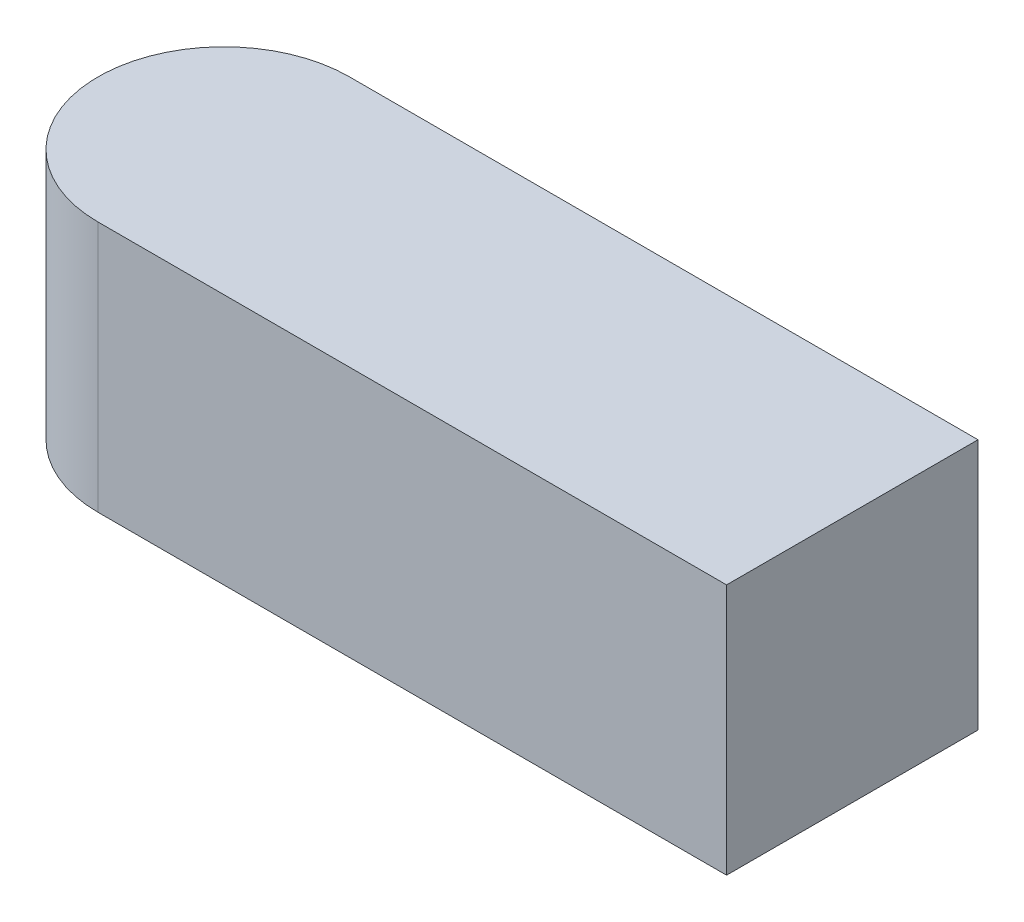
ISO-10303-21;
HEADER;
FILE_DESCRIPTION(('STEP AP214'),'2;1');
FILE_NAME('part.step','',(''),(''),'','','');
FILE_SCHEMA(('AUTOMOTIVE_DESIGN { 1 0 10303 214 1 1 1 1 }'));
ENDSEC;
DATA;
#1=APPLICATION_CONTEXT('core data for automotive mechanical design processes');
#2=APPLICATION_PROTOCOL_DEFINITION('international standard','automotive_design',2000,#1);
#3=PRODUCT_CONTEXT('',#1,'mechanical');
#4=PRODUCT('Part','Part','',(#3));
#5=PRODUCT_RELATED_PRODUCT_CATEGORY('part','',(#4));
#6=PRODUCT_DEFINITION_FORMATION('','',#4);
#7=PRODUCT_DEFINITION_CONTEXT('part definition',#1,'design');
#8=PRODUCT_DEFINITION('design','',#6,#7);
#9=PRODUCT_DEFINITION_SHAPE('','',#8);
#10=(LENGTH_UNIT() NAMED_UNIT(*) SI_UNIT(.MILLI.,.METRE.));
#11=(NAMED_UNIT(*) PLANE_ANGLE_UNIT() SI_UNIT($,.RADIAN.));
#12=(NAMED_UNIT(*) SI_UNIT($,.STERADIAN.) SOLID_ANGLE_UNIT());
#13=UNCERTAINTY_MEASURE_WITH_UNIT(LENGTH_MEASURE(1.E-05),#10,'distance_accuracy_value','');
#14=(GEOMETRIC_REPRESENTATION_CONTEXT(3) GLOBAL_UNCERTAINTY_ASSIGNED_CONTEXT((#13)) GLOBAL_UNIT_ASSIGNED_CONTEXT((#10,
#11,#12)) REPRESENTATION_CONTEXT('',''));
#15=CARTESIAN_POINT('',(0.,0.,0.));
#16=DIRECTION('',(0.,0.,1.));
#17=DIRECTION('',(1.,0.,0.));
#18=AXIS2_PLACEMENT_3D('',#15,#16,#17);
#19=CARTESIAN_POINT('',(15.,6.,-3.));
#20=DIRECTION('',(-1.,0.,0.));
#21=DIRECTION('',(0.,0.,1.));
#22=AXIS2_PLACEMENT_3D('',#19,#20,#21);
#23=PLANE('',#22);
#24=DIRECTION('',(0.,0.,-1.));
#25=VECTOR('',#24,1.);
#26=CARTESIAN_POINT('',(15.,0.,-3.));
#27=LINE('',#26,#25);
#28=CARTESIAN_POINT('',(15.,0.,3.));
#29=VERTEX_POINT('',#28);
#30=CARTESIAN_POINT('',(15.,0.,-3.));
#31=VERTEX_POINT('',#30);
#32=EDGE_CURVE('E76',#29,#31,#27,.T.);
#33=ORIENTED_EDGE('',*,*,#32,.T.);
#34=DIRECTION('',(0.,-1.,0.));
#35=VECTOR('',#34,1.);
#36=CARTESIAN_POINT('',(15.,6.,-3.));
#37=LINE('',#36,#35);
#38=CARTESIAN_POINT('',(15.,6.,-3.));
#39=VERTEX_POINT('',#38);
#40=EDGE_CURVE('E11',#39,#31,#37,.T.);
#41=ORIENTED_EDGE('',*,*,#40,.F.);
#42=DIRECTION('',(0.,0.,-1.));
#43=VECTOR('',#42,1.);
#44=CARTESIAN_POINT('',(15.,6.,-3.));
#45=LINE('',#44,#43);
#46=CARTESIAN_POINT('',(15.,6.,3.));
#47=VERTEX_POINT('',#46);
#48=EDGE_CURVE('E94',#47,#39,#45,.T.);
#49=ORIENTED_EDGE('',*,*,#48,.F.);
#50=DIRECTION('',(0.,-1.,0.));
#51=VECTOR('',#50,1.);
#52=CARTESIAN_POINT('',(15.,6.,3.));
#53=LINE('',#52,#51);
#54=EDGE_CURVE('E88',#47,#29,#53,.T.);
#55=ORIENTED_EDGE('',*,*,#54,.T.);
#56=EDGE_LOOP('',(#33,#41,#49,#55));
#57=FACE_BOUND('',#56,.T.);
#58=ADVANCED_FACE('F32',(#57),#23,.F.);
#59=CARTESIAN_POINT('',(0.,6.,-3.));
#60=DIRECTION('',(0.,0.,1.));
#61=DIRECTION('',(1.,0.,0.));
#62=AXIS2_PLACEMENT_3D('',#59,#60,#61);
#63=PLANE('',#62);
#64=DIRECTION('',(-1.,0.,0.));
#65=VECTOR('',#64,1.);
#66=CARTESIAN_POINT('',(0.,0.,-3.));
#67=LINE('',#66,#65);
#68=CARTESIAN_POINT('',(0.,0.,-3.));
#69=VERTEX_POINT('',#68);
#70=EDGE_CURVE('E72',#31,#69,#67,.T.);
#71=ORIENTED_EDGE('',*,*,#70,.T.);
#72=DIRECTION('',(0.,-1.,0.));
#73=VECTOR('',#72,1.);
#74=CARTESIAN_POINT('',(0.,6.,-3.));
#75=LINE('',#74,#73);
#76=CARTESIAN_POINT('',(0.,6.,-3.));
#77=VERTEX_POINT('',#76);
#78=EDGE_CURVE('E39',#77,#69,#75,.T.);
#79=ORIENTED_EDGE('',*,*,#78,.F.);
#80=DIRECTION('',(-1.,0.,0.));
#81=VECTOR('',#80,1.);
#82=CARTESIAN_POINT('',(0.,6.,-3.));
#83=LINE('',#82,#81);
#84=EDGE_CURVE('E84',#39,#77,#83,.T.);
#85=ORIENTED_EDGE('',*,*,#84,.F.);
#86=ORIENTED_EDGE('',*,*,#40,.T.);
#87=EDGE_LOOP('',(#71,#79,#85,#86));
#88=FACE_BOUND('',#87,.T.);
#89=ADVANCED_FACE('F83',(#88),#63,.F.);
#90=CARTESIAN_POINT('',(0.,6.,0.));
#91=DIRECTION('',(0.,-1.,0.));
#92=DIRECTION('',(0.,0.,-1.));
#93=AXIS2_PLACEMENT_3D('',#90,#91,#92);
#94=CYLINDRICAL_SURFACE('',#93,3.);
#95=CARTESIAN_POINT('',(0.,0.,0.));
#96=DIRECTION('',(0.,1.,0.));
#97=DIRECTION('',(0.,0.,1.));
#98=AXIS2_PLACEMENT_3D('',#95,#96,#97);
#99=CIRCLE('',#98,3.);
#100=CARTESIAN_POINT('',(0.,0.,3.));
#101=VERTEX_POINT('',#100);
#102=EDGE_CURVE('E77',#69,#101,#99,.T.);
#103=ORIENTED_EDGE('',*,*,#102,.T.);
#104=DIRECTION('',(0.,-1.,0.));
#105=VECTOR('',#104,1.);
#106=CARTESIAN_POINT('',(0.,6.,3.));
#107=LINE('',#106,#105);
#108=CARTESIAN_POINT('',(0.,6.,3.));
#109=VERTEX_POINT('',#108);
#110=EDGE_CURVE('E100',#109,#101,#107,.T.);
#111=ORIENTED_EDGE('',*,*,#110,.F.);
#112=CARTESIAN_POINT('',(0.,6.,0.));
#113=DIRECTION('',(0.,1.,0.));
#114=DIRECTION('',(0.,0.,1.));
#115=AXIS2_PLACEMENT_3D('',#112,#113,#114);
#116=CIRCLE('',#115,3.);
#117=EDGE_CURVE('E51',#77,#109,#116,.T.);
#118=ORIENTED_EDGE('',*,*,#117,.F.);
#119=ORIENTED_EDGE('',*,*,#78,.T.);
#120=EDGE_LOOP('',(#103,#111,#118,#119));
#121=FACE_BOUND('',#120,.T.);
#122=ADVANCED_FACE('F103',(#121),#94,.T.);
#123=CARTESIAN_POINT('',(0.,6.,3.));
#124=DIRECTION('',(0.,0.,-1.));
#125=DIRECTION('',(-1.,0.,0.));
#126=AXIS2_PLACEMENT_3D('',#123,#124,#125);
#127=PLANE('',#126);
#128=DIRECTION('',(1.,0.,0.));
#129=VECTOR('',#128,1.);
#130=CARTESIAN_POINT('',(0.,0.,3.));
#131=LINE('',#130,#129);
#132=EDGE_CURVE('E92',#101,#29,#131,.T.);
#133=ORIENTED_EDGE('',*,*,#132,.T.);
#134=ORIENTED_EDGE('',*,*,#54,.F.);
#135=DIRECTION('',(1.,0.,0.));
#136=VECTOR('',#135,1.);
#137=CARTESIAN_POINT('',(0.,6.,3.));
#138=LINE('',#137,#136);
#139=EDGE_CURVE('E46',#109,#47,#138,.T.);
#140=ORIENTED_EDGE('',*,*,#139,.F.);
#141=ORIENTED_EDGE('',*,*,#110,.T.);
#142=EDGE_LOOP('',(#133,#134,#140,#141));
#143=FACE_BOUND('',#142,.T.);
#144=ADVANCED_FACE('F105',(#143),#127,.F.);
#145=CARTESIAN_POINT('',(0.,6.,0.));
#146=DIRECTION('',(0.,1.,0.));
#147=DIRECTION('',(0.,0.,1.));
#148=AXIS2_PLACEMENT_3D('',#145,#146,#147);
#149=PLANE('',#148);
#150=ORIENTED_EDGE('',*,*,#48,.T.);
#151=ORIENTED_EDGE('',*,*,#84,.T.);
#152=ORIENTED_EDGE('',*,*,#117,.T.);
#153=ORIENTED_EDGE('',*,*,#139,.T.);
#154=EDGE_LOOP('',(#150,#151,#152,#153));
#155=FACE_BOUND('',#154,.T.);
#156=ADVANCED_FACE('F106',(#155),#149,.T.);
#157=CARTESIAN_POINT('',(0.,0.,0.));
#158=DIRECTION('',(0.,1.,0.));
#159=DIRECTION('',(0.,0.,1.));
#160=AXIS2_PLACEMENT_3D('',#157,#158,#159);
#161=PLANE('',#160);
#162=ORIENTED_EDGE('',*,*,#32,.F.);
#163=ORIENTED_EDGE('',*,*,#132,.F.);
#164=ORIENTED_EDGE('',*,*,#102,.F.);
#165=ORIENTED_EDGE('',*,*,#70,.F.);
#166=EDGE_LOOP('',(#162,#163,#164,#165));
#167=FACE_BOUND('',#166,.T.);
#168=ADVANCED_FACE('F73',(#167),#161,.F.);
#169=CLOSED_SHELL('',(#58,#89,#122,#144,#156,#168));
#170=MANIFOLD_SOLID_BREP('B2',#169);
#171=ADVANCED_BREP_SHAPE_REPRESENTATION('',(#18,#170),#14);
#172=SHAPE_DEFINITION_REPRESENTATION(#9,#171);
ENDSEC;
END-ISO-10303-21;
